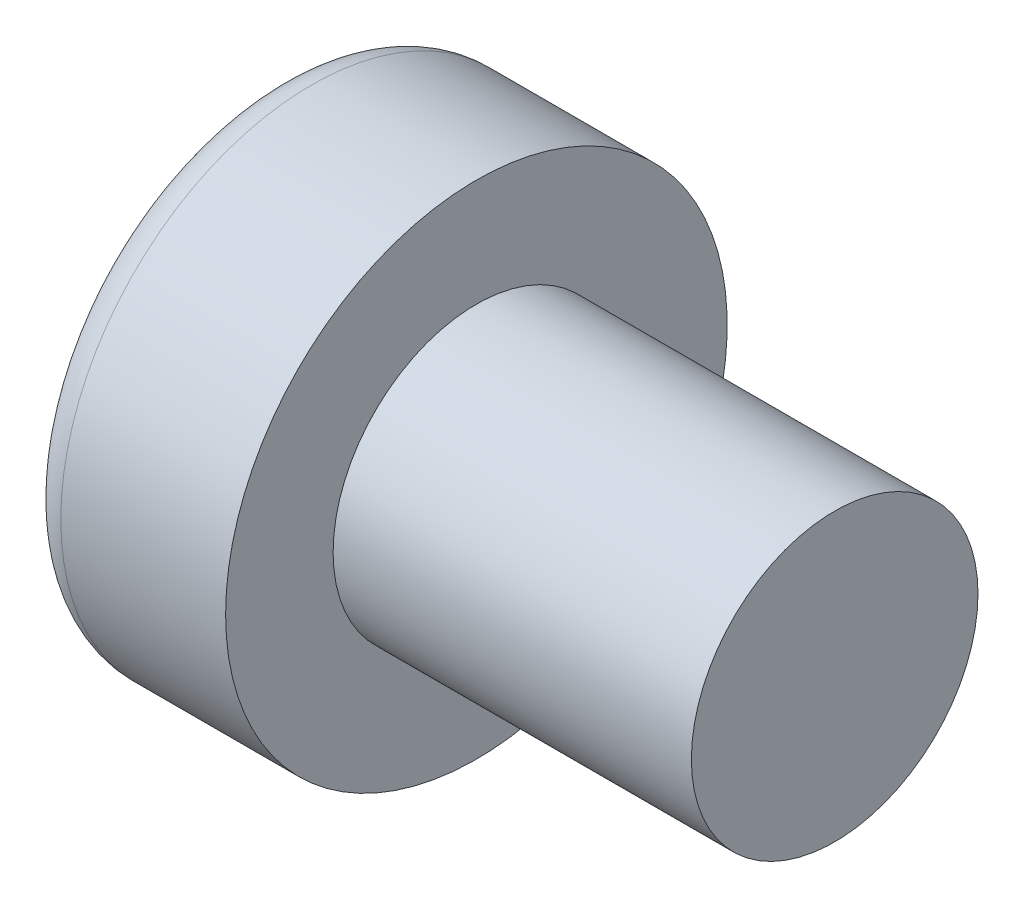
ISO-10303-21;
HEADER;
FILE_DESCRIPTION(('STEP AP214'),'2;1');
FILE_NAME('part.step','',(''),(''),'','','');
FILE_SCHEMA(('AUTOMOTIVE_DESIGN { 1 0 10303 214 1 1 1 1 }'));
ENDSEC;
DATA;
#1=APPLICATION_CONTEXT('core data for automotive mechanical design processes');
#2=APPLICATION_PROTOCOL_DEFINITION('international standard','automotive_design',2000,#1);
#3=PRODUCT_CONTEXT('',#1,'mechanical');
#4=PRODUCT('Part','Part','',(#3));
#5=PRODUCT_RELATED_PRODUCT_CATEGORY('part','',(#4));
#6=PRODUCT_DEFINITION_FORMATION('','',#4);
#7=PRODUCT_DEFINITION_CONTEXT('part definition',#1,'design');
#8=PRODUCT_DEFINITION('design','',#6,#7);
#9=PRODUCT_DEFINITION_SHAPE('','',#8);
#10=(LENGTH_UNIT() NAMED_UNIT(*) SI_UNIT(.MILLI.,.METRE.));
#11=(NAMED_UNIT(*) PLANE_ANGLE_UNIT() SI_UNIT($,.RADIAN.));
#12=(NAMED_UNIT(*) SI_UNIT($,.STERADIAN.) SOLID_ANGLE_UNIT());
#13=UNCERTAINTY_MEASURE_WITH_UNIT(LENGTH_MEASURE(1.E-05),#10,'distance_accuracy_value','');
#14=(GEOMETRIC_REPRESENTATION_CONTEXT(3) GLOBAL_UNCERTAINTY_ASSIGNED_CONTEXT((#13)) GLOBAL_UNIT_ASSIGNED_CONTEXT((#10,
#11,#12)) REPRESENTATION_CONTEXT('',''));
#15=CARTESIAN_POINT('',(0.,0.,0.));
#16=DIRECTION('',(0.,0.,1.));
#17=DIRECTION('',(1.,0.,0.));
#18=AXIS2_PLACEMENT_3D('',#15,#16,#17);
#19=CARTESIAN_POINT('',(-5.,3.5,0.));
#20=DIRECTION('',(-1.,0.,0.));
#21=DIRECTION('',(0.,0.,1.));
#22=AXIS2_PLACEMENT_3D('',#19,#20,#21);
#23=PLANE('',#22);
#24=CARTESIAN_POINT('',(-5.,0.,0.));
#25=DIRECTION('',(-1.,0.,0.));
#26=DIRECTION('',(0.,0.,1.));
#27=AXIS2_PLACEMENT_3D('',#24,#25,#26);
#28=CIRCLE('',#27,3.5);
#29=CARTESIAN_POINT('',(-5.,0.,3.5));
#30=VERTEX_POINT('',#29);
#31=EDGE_CURVE('E148',#30,#30,#28,.T.);
#32=ORIENTED_EDGE('',*,*,#31,.F.);
#33=EDGE_LOOP('',(#32));
#34=FACE_BOUND('',#33,.T.);
#35=CARTESIAN_POINT('',(-5.,0.,0.));
#36=DIRECTION('',(-1.,0.,0.));
#37=DIRECTION('',(0.,0.,1.));
#38=AXIS2_PLACEMENT_3D('',#35,#36,#37);
#39=CIRCLE('',#38,2.);
#40=CARTESIAN_POINT('',(-5.,0.,2.));
#41=VERTEX_POINT('',#40);
#42=EDGE_CURVE('E137',#41,#41,#39,.T.);
#43=ORIENTED_EDGE('',*,*,#42,.T.);
#44=EDGE_LOOP('',(#43));
#45=FACE_BOUND('',#44,.T.);
#46=ADVANCED_FACE('F35',(#34,#45),#23,.F.);
#47=CARTESIAN_POINT('',(-65.0118083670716,0.,0.));
#48=DIRECTION('',(-1.,0.,0.));
#49=DIRECTION('',(0.,0.,1.));
#50=AXIS2_PLACEMENT_3D('',#47,#48,#49);
#51=CYLINDRICAL_SURFACE('',#50,3.5);
#52=CARTESIAN_POINT('',(-7.3,0.,0.));
#53=DIRECTION('',(1.,0.,0.));
#54=DIRECTION('',(0.,0.,-1.));
#55=AXIS2_PLACEMENT_3D('',#52,#53,#54);
#56=CIRCLE('',#55,3.5);
#57=CARTESIAN_POINT('',(-7.3,0.,-3.5));
#58=VERTEX_POINT('',#57);
#59=EDGE_CURVE('E11',#58,#58,#56,.T.);
#60=ORIENTED_EDGE('',*,*,#59,.T.);
#61=EDGE_LOOP('',(#60));
#62=FACE_BOUND('',#61,.T.);
#63=ORIENTED_EDGE('',*,*,#31,.T.);
#64=EDGE_LOOP('',(#63));
#65=FACE_BOUND('',#64,.T.);
#66=ADVANCED_FACE('F170',(#62,#65),#51,.T.);
#67=CARTESIAN_POINT('',(-7.8,0.,0.));
#68=DIRECTION('',(1.,0.,0.));
#69=DIRECTION('',(0.,0.,-1.));
#70=AXIS2_PLACEMENT_3D('',#67,#68,#69);
#71=PLANE('',#70);
#72=DIRECTION('',(0.,0.5,-0.866025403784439));
#73=VECTOR('',#72,1.);
#74=CARTESIAN_POINT('',(-7.8,0.721687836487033,1.25));
#75=LINE('',#74,#73);
#76=CARTESIAN_POINT('',(-7.8,0.721687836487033,1.25));
#77=VERTEX_POINT('',#76);
#78=CARTESIAN_POINT('',(-7.8,1.44337567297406,0.));
#79=VERTEX_POINT('',#78);
#80=EDGE_CURVE('E124',#77,#79,#75,.T.);
#81=ORIENTED_EDGE('',*,*,#80,.F.);
#82=DIRECTION('',(0.,1.,0.));
#83=VECTOR('',#82,1.);
#84=CARTESIAN_POINT('',(-7.8,-0.721687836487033,1.25));
#85=LINE('',#84,#83);
#86=CARTESIAN_POINT('',(-7.8,-0.721687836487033,1.25));
#87=VERTEX_POINT('',#86);
#88=EDGE_CURVE('E50',#87,#77,#85,.T.);
#89=ORIENTED_EDGE('',*,*,#88,.F.);
#90=DIRECTION('',(0.,0.5,0.866025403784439));
#91=VECTOR('',#90,1.);
#92=CARTESIAN_POINT('',(-7.8,-1.44337567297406,0.));
#93=LINE('',#92,#91);
#94=CARTESIAN_POINT('',(-7.8,-1.44337567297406,0.));
#95=VERTEX_POINT('',#94);
#96=EDGE_CURVE('E133',#95,#87,#93,.T.);
#97=ORIENTED_EDGE('',*,*,#96,.F.);
#98=DIRECTION('',(0.,-0.5,0.866025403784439));
#99=VECTOR('',#98,1.);
#100=CARTESIAN_POINT('',(-7.8,-0.721687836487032,-1.25));
#101=LINE('',#100,#99);
#102=CARTESIAN_POINT('',(-7.8,-0.721687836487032,-1.25));
#103=VERTEX_POINT('',#102);
#104=EDGE_CURVE('E131',#103,#95,#101,.T.);
#105=ORIENTED_EDGE('',*,*,#104,.F.);
#106=DIRECTION('',(0.,-1.,0.));
#107=VECTOR('',#106,1.);
#108=CARTESIAN_POINT('',(-7.8,0.721687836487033,-1.25));
#109=LINE('',#108,#107);
#110=CARTESIAN_POINT('',(-7.8,0.721687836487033,-1.25));
#111=VERTEX_POINT('',#110);
#112=EDGE_CURVE('E98',#111,#103,#109,.T.);
#113=ORIENTED_EDGE('',*,*,#112,.F.);
#114=DIRECTION('',(0.,-0.5,-0.866025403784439));
#115=VECTOR('',#114,1.);
#116=CARTESIAN_POINT('',(-7.8,1.44337567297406,0.));
#117=LINE('',#116,#115);
#118=EDGE_CURVE('E127',#79,#111,#117,.T.);
#119=ORIENTED_EDGE('',*,*,#118,.F.);
#120=EDGE_LOOP('',(#81,#89,#97,#105,#113,#119));
#121=FACE_BOUND('',#120,.T.);
#122=CARTESIAN_POINT('',(-7.8,0.,0.));
#123=DIRECTION('',(1.,0.,0.));
#124=DIRECTION('',(0.,0.,-1.));
#125=AXIS2_PLACEMENT_3D('',#122,#123,#124);
#126=CIRCLE('',#125,3.);
#127=CARTESIAN_POINT('',(-7.8,0.,-3.));
#128=VERTEX_POINT('',#127);
#129=EDGE_CURVE('E43',#128,#128,#126,.F.);
#130=ORIENTED_EDGE('',*,*,#129,.T.);
#131=EDGE_LOOP('',(#130));
#132=FACE_BOUND('',#131,.T.);
#133=ADVANCED_FACE('F153',(#121,#132),#71,.F.);
#134=CARTESIAN_POINT('',(0.,2.,0.));
#135=DIRECTION('',(-1.,0.,0.));
#136=DIRECTION('',(0.,0.,1.));
#137=AXIS2_PLACEMENT_3D('',#134,#135,#136);
#138=PLANE('',#137);
#139=CARTESIAN_POINT('',(0.,0.,0.));
#140=DIRECTION('',(-1.,0.,0.));
#141=DIRECTION('',(0.,0.,1.));
#142=AXIS2_PLACEMENT_3D('',#139,#140,#141);
#143=CIRCLE('',#142,2.);
#144=CARTESIAN_POINT('',(0.,0.,2.));
#145=VERTEX_POINT('',#144);
#146=EDGE_CURVE('E145',#145,#145,#143,.T.);
#147=ORIENTED_EDGE('',*,*,#146,.F.);
#148=EDGE_LOOP('',(#147));
#149=FACE_BOUND('',#148,.T.);
#150=ADVANCED_FACE('F165',(#149),#138,.F.);
#151=CARTESIAN_POINT('',(-65.0118083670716,0.,0.));
#152=DIRECTION('',(-1.,0.,0.));
#153=DIRECTION('',(0.,0.,1.));
#154=AXIS2_PLACEMENT_3D('',#151,#152,#153);
#155=CYLINDRICAL_SURFACE('',#154,2.);
#156=ORIENTED_EDGE('',*,*,#42,.F.);
#157=EDGE_LOOP('',(#156));
#158=FACE_BOUND('',#157,.T.);
#159=ORIENTED_EDGE('',*,*,#146,.T.);
#160=EDGE_LOOP('',(#159));
#161=FACE_BOUND('',#160,.T.);
#162=ADVANCED_FACE('F157',(#158,#161),#155,.T.);
#163=CARTESIAN_POINT('',(-7.3,0.,0.));
#164=DIRECTION('',(1.,0.,0.));
#165=DIRECTION('',(0.,0.,-1.));
#166=AXIS2_PLACEMENT_3D('',#163,#164,#165);
#167=TOROIDAL_SURFACE('',#166,3.,0.5);
#168=ORIENTED_EDGE('',*,*,#59,.F.);
#169=EDGE_LOOP('',(#168));
#170=FACE_BOUND('',#169,.T.);
#171=ORIENTED_EDGE('',*,*,#129,.F.);
#172=EDGE_LOOP('',(#171));
#173=FACE_BOUND('',#172,.T.);
#174=ADVANCED_FACE('F37',(#170,#173),#167,.T.);
#175=CARTESIAN_POINT('',(-4.8,-0.721687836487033,1.25));
#176=DIRECTION('',(0.,0.,1.));
#177=DIRECTION('',(0.,-1.,0.));
#178=AXIS2_PLACEMENT_3D('',#175,#176,#177);
#179=PLANE('',#178);
#180=ORIENTED_EDGE('',*,*,#88,.T.);
#181=DIRECTION('',(-1.,0.,0.));
#182=VECTOR('',#181,1.);
#183=CARTESIAN_POINT('',(-4.8,0.721687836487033,1.25));
#184=LINE('',#183,#182);
#185=CARTESIAN_POINT('',(-4.8,0.721687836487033,1.25));
#186=VERTEX_POINT('',#185);
#187=EDGE_CURVE('E80',#186,#77,#184,.T.);
#188=ORIENTED_EDGE('',*,*,#187,.F.);
#189=DIRECTION('',(0.,1.,0.));
#190=VECTOR('',#189,1.);
#191=CARTESIAN_POINT('',(-4.8,-0.721687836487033,1.25));
#192=LINE('',#191,#190);
#193=CARTESIAN_POINT('',(-4.8,-0.721687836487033,1.25));
#194=VERTEX_POINT('',#193);
#195=EDGE_CURVE('E135',#194,#186,#192,.T.);
#196=ORIENTED_EDGE('',*,*,#195,.F.);
#197=DIRECTION('',(-1.,0.,0.));
#198=VECTOR('',#197,1.);
#199=CARTESIAN_POINT('',(-4.8,-0.721687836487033,1.25));
#200=LINE('',#199,#198);
#201=EDGE_CURVE('E58',#194,#87,#200,.T.);
#202=ORIENTED_EDGE('',*,*,#201,.T.);
#203=EDGE_LOOP('',(#180,#188,#196,#202));
#204=FACE_BOUND('',#203,.T.);
#205=ADVANCED_FACE('F156',(#204),#179,.F.);
#206=CARTESIAN_POINT('',(-4.8,-1.44337567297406,0.));
#207=DIRECTION('',(0.,-0.866025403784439,0.5));
#208=DIRECTION('',(0.,-0.5,-0.866025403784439));
#209=AXIS2_PLACEMENT_3D('',#206,#207,#208);
#210=PLANE('',#209);
#211=ORIENTED_EDGE('',*,*,#96,.T.);
#212=ORIENTED_EDGE('',*,*,#201,.F.);
#213=DIRECTION('',(0.,0.5,0.866025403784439));
#214=VECTOR('',#213,1.);
#215=CARTESIAN_POINT('',(-4.8,-1.44337567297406,0.));
#216=LINE('',#215,#214);
#217=CARTESIAN_POINT('',(-4.8,-1.44337567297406,0.));
#218=VERTEX_POINT('',#217);
#219=EDGE_CURVE('E110',#218,#194,#216,.T.);
#220=ORIENTED_EDGE('',*,*,#219,.F.);
#221=DIRECTION('',(-1.,0.,0.));
#222=VECTOR('',#221,1.);
#223=CARTESIAN_POINT('',(-4.8,-1.44337567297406,0.));
#224=LINE('',#223,#222);
#225=EDGE_CURVE('E102',#218,#95,#224,.T.);
#226=ORIENTED_EDGE('',*,*,#225,.T.);
#227=EDGE_LOOP('',(#211,#212,#220,#226));
#228=FACE_BOUND('',#227,.T.);
#229=ADVANCED_FACE('F163',(#228),#210,.F.);
#230=CARTESIAN_POINT('',(-4.8,-0.721687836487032,-1.25));
#231=DIRECTION('',(0.,-0.866025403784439,-0.5));
#232=DIRECTION('',(0.,0.5,-0.866025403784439));
#233=AXIS2_PLACEMENT_3D('',#230,#231,#232);
#234=PLANE('',#233);
#235=ORIENTED_EDGE('',*,*,#104,.T.);
#236=ORIENTED_EDGE('',*,*,#225,.F.);
#237=DIRECTION('',(0.,-0.5,0.866025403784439));
#238=VECTOR('',#237,1.);
#239=CARTESIAN_POINT('',(-4.8,-0.721687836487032,-1.25));
#240=LINE('',#239,#238);
#241=CARTESIAN_POINT('',(-4.8,-0.721687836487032,-1.25));
#242=VERTEX_POINT('',#241);
#243=EDGE_CURVE('E106',#242,#218,#240,.T.);
#244=ORIENTED_EDGE('',*,*,#243,.F.);
#245=DIRECTION('',(-1.,0.,0.));
#246=VECTOR('',#245,1.);
#247=CARTESIAN_POINT('',(-4.8,-0.721687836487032,-1.25));
#248=LINE('',#247,#246);
#249=EDGE_CURVE('E91',#242,#103,#248,.T.);
#250=ORIENTED_EDGE('',*,*,#249,.T.);
#251=EDGE_LOOP('',(#235,#236,#244,#250));
#252=FACE_BOUND('',#251,.T.);
#253=ADVANCED_FACE('F107',(#252),#234,.F.);
#254=CARTESIAN_POINT('',(-4.8,0.721687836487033,-1.25));
#255=DIRECTION('',(0.,0.,-1.));
#256=DIRECTION('',(-1.,0.,0.));
#257=AXIS2_PLACEMENT_3D('',#254,#255,#256);
#258=PLANE('',#257);
#259=ORIENTED_EDGE('',*,*,#112,.T.);
#260=ORIENTED_EDGE('',*,*,#249,.F.);
#261=DIRECTION('',(0.,-1.,0.));
#262=VECTOR('',#261,1.);
#263=CARTESIAN_POINT('',(-4.8,0.721687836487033,-1.25));
#264=LINE('',#263,#262);
#265=CARTESIAN_POINT('',(-4.8,0.721687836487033,-1.25));
#266=VERTEX_POINT('',#265);
#267=EDGE_CURVE('E95',#266,#242,#264,.T.);
#268=ORIENTED_EDGE('',*,*,#267,.F.);
#269=DIRECTION('',(-1.,0.,0.));
#270=VECTOR('',#269,1.);
#271=CARTESIAN_POINT('',(-4.8,0.721687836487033,-1.25));
#272=LINE('',#271,#270);
#273=EDGE_CURVE('E103',#266,#111,#272,.T.);
#274=ORIENTED_EDGE('',*,*,#273,.T.);
#275=EDGE_LOOP('',(#259,#260,#268,#274));
#276=FACE_BOUND('',#275,.T.);
#277=ADVANCED_FACE('F93',(#276),#258,.F.);
#278=CARTESIAN_POINT('',(-4.8,1.44337567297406,0.));
#279=DIRECTION('',(0.,0.866025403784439,-0.5));
#280=DIRECTION('',(0.,0.5,0.866025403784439));
#281=AXIS2_PLACEMENT_3D('',#278,#279,#280);
#282=PLANE('',#281);
#283=ORIENTED_EDGE('',*,*,#118,.T.);
#284=ORIENTED_EDGE('',*,*,#273,.F.);
#285=DIRECTION('',(0.,-0.5,-0.866025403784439));
#286=VECTOR('',#285,1.);
#287=CARTESIAN_POINT('',(-4.8,1.44337567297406,0.));
#288=LINE('',#287,#286);
#289=CARTESIAN_POINT('',(-4.8,1.44337567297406,0.));
#290=VERTEX_POINT('',#289);
#291=EDGE_CURVE('E116',#290,#266,#288,.T.);
#292=ORIENTED_EDGE('',*,*,#291,.F.);
#293=DIRECTION('',(-1.,0.,0.));
#294=VECTOR('',#293,1.);
#295=CARTESIAN_POINT('',(-4.8,1.44337567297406,0.));
#296=LINE('',#295,#294);
#297=EDGE_CURVE('E140',#290,#79,#296,.T.);
#298=ORIENTED_EDGE('',*,*,#297,.T.);
#299=EDGE_LOOP('',(#283,#284,#292,#298));
#300=FACE_BOUND('',#299,.T.);
#301=ADVANCED_FACE('F189',(#300),#282,.F.);
#302=CARTESIAN_POINT('',(-4.8,0.721687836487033,1.25));
#303=DIRECTION('',(0.,0.866025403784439,0.5));
#304=DIRECTION('',(0.,-0.5,0.866025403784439));
#305=AXIS2_PLACEMENT_3D('',#302,#303,#304);
#306=PLANE('',#305);
#307=ORIENTED_EDGE('',*,*,#80,.T.);
#308=ORIENTED_EDGE('',*,*,#297,.F.);
#309=DIRECTION('',(0.,0.5,-0.866025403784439));
#310=VECTOR('',#309,1.);
#311=CARTESIAN_POINT('',(-4.8,0.721687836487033,1.25));
#312=LINE('',#311,#310);
#313=EDGE_CURVE('E118',#186,#290,#312,.T.);
#314=ORIENTED_EDGE('',*,*,#313,.F.);
#315=ORIENTED_EDGE('',*,*,#187,.T.);
#316=EDGE_LOOP('',(#307,#308,#314,#315));
#317=FACE_BOUND('',#316,.T.);
#318=ADVANCED_FACE('F186',(#317),#306,.F.);
#319=CARTESIAN_POINT('',(-4.8,0.,0.));
#320=DIRECTION('',(-1.,0.,0.));
#321=DIRECTION('',(0.,0.,1.));
#322=AXIS2_PLACEMENT_3D('',#319,#320,#321);
#323=PLANE('',#322);
#324=ORIENTED_EDGE('',*,*,#195,.T.);
#325=ORIENTED_EDGE('',*,*,#313,.T.);
#326=ORIENTED_EDGE('',*,*,#291,.T.);
#327=ORIENTED_EDGE('',*,*,#267,.T.);
#328=ORIENTED_EDGE('',*,*,#243,.T.);
#329=ORIENTED_EDGE('',*,*,#219,.T.);
#330=EDGE_LOOP('',(#324,#325,#326,#327,#328,#329));
#331=FACE_BOUND('',#330,.T.);
#332=ADVANCED_FACE('F113',(#331),#323,.T.);
#333=CLOSED_SHELL('',(#46,#66,#133,#150,#162,#174,#205,#229,#253,#277,#301,#318,#332));
#334=MANIFOLD_SOLID_BREP('B2',#333);
#335=ADVANCED_BREP_SHAPE_REPRESENTATION('',(#18,#334),#14);
#336=SHAPE_DEFINITION_REPRESENTATION(#9,#335);
ENDSEC;
END-ISO-10303-21;
